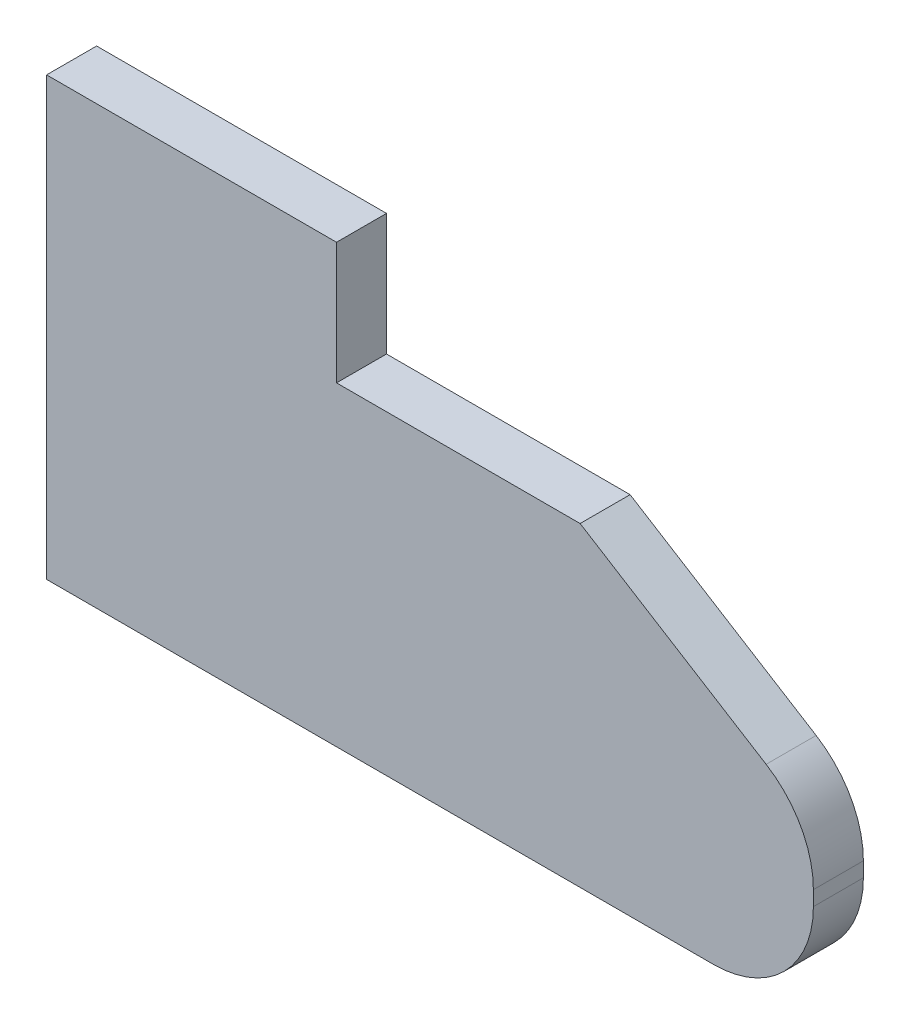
from build123d import *

# Parameters (mm, degrees)
EXTRUDE1_DEPTH = 5


with BuildPart() as part:
    # Sketch1 → Extrude1 (new body)
    with BuildSketch(Plane.XY):
        with BuildLine():
            Line((28.989946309, 43.695639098), (28.989946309, 31.516874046))
            Line((28.989946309, 31.516874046), (53.350981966, 31.516874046))
            Line((53.350981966, 31.516874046), (71.952767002, 19.965797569))
            ThreePointArc((71.952767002, 19.965797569), (75.416815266, 16.330837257), (76.677443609, 11.470448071))
            Line((76.677443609, 11.470448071), (76.677443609, 10))
            ThreePointArc((76.677443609, 10), (73.748511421, 2.928932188), (66.677443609, 0))
            Line((66.677443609, 0), (0, 0))
            Line((0, 0), (0, 43.695639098))
            Line((0, 43.695639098), (28.989946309, 43.695639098))
        make_face()
    extrude(amount=EXTRUDE1_DEPTH)


solid = part.part
